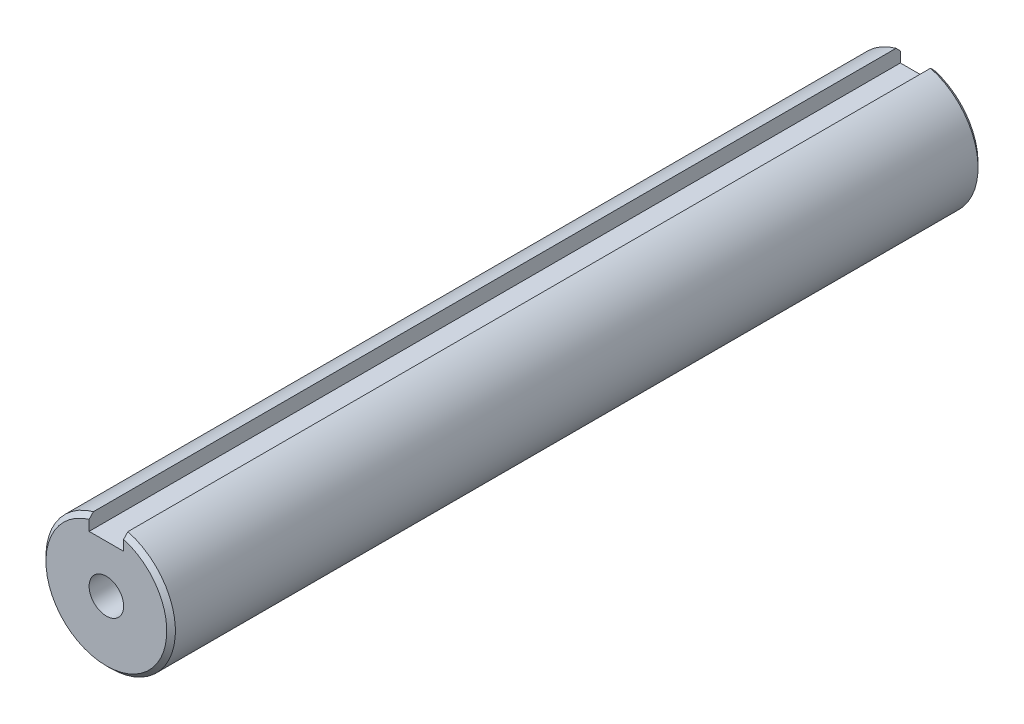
ISO-10303-21;
HEADER;
FILE_DESCRIPTION(('STEP AP214'),'2;1');
FILE_NAME('part.step','',(''),(''),'','','');
FILE_SCHEMA(('AUTOMOTIVE_DESIGN { 1 0 10303 214 1 1 1 1 }'));
ENDSEC;
DATA;
#1=APPLICATION_CONTEXT('core data for automotive mechanical design processes');
#2=APPLICATION_PROTOCOL_DEFINITION('international standard','automotive_design',2000,#1);
#3=PRODUCT_CONTEXT('',#1,'mechanical');
#4=PRODUCT('Part','Part','',(#3));
#5=PRODUCT_RELATED_PRODUCT_CATEGORY('part','',(#4));
#6=PRODUCT_DEFINITION_FORMATION('','',#4);
#7=PRODUCT_DEFINITION_CONTEXT('part definition',#1,'design');
#8=PRODUCT_DEFINITION('design','',#6,#7);
#9=PRODUCT_DEFINITION_SHAPE('','',#8);
#10=(LENGTH_UNIT() NAMED_UNIT(*) SI_UNIT(.MILLI.,.METRE.));
#11=(NAMED_UNIT(*) PLANE_ANGLE_UNIT() SI_UNIT($,.RADIAN.));
#12=(NAMED_UNIT(*) SI_UNIT($,.STERADIAN.) SOLID_ANGLE_UNIT());
#13=UNCERTAINTY_MEASURE_WITH_UNIT(LENGTH_MEASURE(1.E-05),#10,'distance_accuracy_value','');
#14=(GEOMETRIC_REPRESENTATION_CONTEXT(3) GLOBAL_UNCERTAINTY_ASSIGNED_CONTEXT((#13)) GLOBAL_UNIT_ASSIGNED_CONTEXT((#10,
#11,#12)) REPRESENTATION_CONTEXT('',''));
#15=CARTESIAN_POINT('',(0.,0.,0.));
#16=DIRECTION('',(0.,0.,1.));
#17=DIRECTION('',(1.,0.,0.));
#18=AXIS2_PLACEMENT_3D('',#15,#16,#17);
#19=CARTESIAN_POINT('',(0.,0.,94.));
#20=DIRECTION('',(0.,0.,-1.));
#21=DIRECTION('',(-1.,0.,0.));
#22=AXIS2_PLACEMENT_3D('',#19,#20,#21);
#23=CYLINDRICAL_SURFACE('',#22,15.);
#24=DIRECTION('',(0.,0.,-1.));
#25=VECTOR('',#24,1.);
#26=CARTESIAN_POINT('',(-4.,14.456832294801,94.));
#27=LINE('',#26,#25);
#28=CARTESIAN_POINT('',(-4.,14.456832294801,93.));
#29=VERTEX_POINT('',#28);
#30=CARTESIAN_POINT('',(-4.,14.456832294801,-93.));
#31=VERTEX_POINT('',#30);
#32=EDGE_CURVE('E135',#29,#31,#27,.T.);
#33=ORIENTED_EDGE('',*,*,#32,.T.);
#34=CARTESIAN_POINT('',(0.,0.,-93.));
#35=DIRECTION('',(0.,0.,1.));
#36=DIRECTION('',(1.,0.,0.));
#37=AXIS2_PLACEMENT_3D('',#34,#35,#36);
#38=CIRCLE('',#37,15.);
#39=CARTESIAN_POINT('',(4.,14.456832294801,-93.));
#40=VERTEX_POINT('',#39);
#41=EDGE_CURVE('E149',#31,#40,#38,.T.);
#42=ORIENTED_EDGE('',*,*,#41,.T.);
#43=DIRECTION('',(0.,0.,-1.));
#44=VECTOR('',#43,1.);
#45=CARTESIAN_POINT('',(4.,14.456832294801,94.));
#46=LINE('',#45,#44);
#47=CARTESIAN_POINT('',(4.,14.456832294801,93.));
#48=VERTEX_POINT('',#47);
#49=EDGE_CURVE('E144',#48,#40,#46,.T.);
#50=ORIENTED_EDGE('',*,*,#49,.F.);
#51=CARTESIAN_POINT('',(0.,0.,93.));
#52=DIRECTION('',(0.,0.,1.));
#53=DIRECTION('',(1.,0.,0.));
#54=AXIS2_PLACEMENT_3D('',#51,#52,#53);
#55=CIRCLE('',#54,15.);
#56=EDGE_CURVE('E147',#48,#29,#55,.F.);
#57=ORIENTED_EDGE('',*,*,#56,.T.);
#58=EDGE_LOOP('',(#33,#42,#50,#57));
#59=FACE_BOUND('',#58,.T.);
#60=ADVANCED_FACE('F31',(#59),#23,.T.);
#61=CARTESIAN_POINT('',(4.,14.456832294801,94.));
#62=DIRECTION('',(1.,0.,0.));
#63=DIRECTION('',(0.,0.,-1.));
#64=AXIS2_PLACEMENT_3D('',#61,#62,#63);
#65=PLANE('',#64);
#66=ORIENTED_EDGE('',*,*,#49,.T.);
#67=CARTESIAN_POINT('',(4.,14.456832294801,-93.));
#68=CARTESIAN_POINT('',(4.,14.2836650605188,-93.166913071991));
#69=CARTESIAN_POINT('',(4.,14.1103794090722,-93.3337029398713));
#70=CARTESIAN_POINT('',(4.,13.7635712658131,-93.6670362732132));
#71=CARTESIAN_POINT('',(4.,13.5900487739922,-93.8335797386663));
#72=CARTESIAN_POINT('',(4.,13.4164078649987,-94.));
#73=B_SPLINE_CURVE_WITH_KNOTS('',3,(#67,#68,#69,#70,#71,#72),.UNSPECIFIED.,.F.,.F.,(4,2,4),(0.,
0.721540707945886,1.44308144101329),.UNSPECIFIED.);
#74=CARTESIAN_POINT('',(4.,13.4164078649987,-94.));
#75=VERTEX_POINT('',#74);
#76=EDGE_CURVE('E158',#40,#75,#73,.T.);
#77=ORIENTED_EDGE('',*,*,#76,.T.);
#78=DIRECTION('',(0.,-1.,0.));
#79=VECTOR('',#78,1.);
#80=CARTESIAN_POINT('',(4.,14.456832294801,-94.));
#81=LINE('',#80,#79);
#82=CARTESIAN_POINT('',(4.,11.,-94.));
#83=VERTEX_POINT('',#82);
#84=EDGE_CURVE('E123',#75,#83,#81,.T.);
#85=ORIENTED_EDGE('',*,*,#84,.T.);
#86=DIRECTION('',(0.,0.,-1.));
#87=VECTOR('',#86,1.);
#88=CARTESIAN_POINT('',(4.,11.,94.));
#89=LINE('',#88,#87);
#90=CARTESIAN_POINT('',(4.,11.,94.));
#91=VERTEX_POINT('',#90);
#92=EDGE_CURVE('E141',#91,#83,#89,.T.);
#93=ORIENTED_EDGE('',*,*,#92,.F.);
#94=DIRECTION('',(0.,-1.,0.));
#95=VECTOR('',#94,1.);
#96=CARTESIAN_POINT('',(4.,14.456832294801,94.));
#97=LINE('',#96,#95);
#98=CARTESIAN_POINT('',(4.,13.4164078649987,94.));
#99=VERTEX_POINT('',#98);
#100=EDGE_CURVE('E129',#99,#91,#97,.T.);
#101=ORIENTED_EDGE('',*,*,#100,.F.);
#102=CARTESIAN_POINT('',(4.,13.4164078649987,94.));
#103=CARTESIAN_POINT('',(4.,13.5900487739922,93.8335797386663));
#104=CARTESIAN_POINT('',(4.,13.7635712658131,93.6670362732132));
#105=CARTESIAN_POINT('',(4.,14.1103794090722,93.3337029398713));
#106=CARTESIAN_POINT('',(4.,14.2836650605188,93.166913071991));
#107=CARTESIAN_POINT('',(4.,14.456832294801,93.));
#108=B_SPLINE_CURVE_WITH_KNOTS('',3,(#102,#103,#104,#105,#106,#107),.UNSPECIFIED.,.F.,.F.,(4,2,
4),(0.,0.7215407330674,1.4430814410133),.UNSPECIFIED.);
#109=EDGE_CURVE('E152',#99,#48,#108,.T.);
#110=ORIENTED_EDGE('',*,*,#109,.T.);
#111=EDGE_LOOP('',(#66,#77,#85,#93,#101,#110));
#112=FACE_BOUND('',#111,.T.);
#113=ADVANCED_FACE('F167',(#112),#65,.F.);
#114=CARTESIAN_POINT('',(-4.,11.,94.));
#115=DIRECTION('',(0.,-1.,0.));
#116=DIRECTION('',(0.,0.,-1.));
#117=AXIS2_PLACEMENT_3D('',#114,#115,#116);
#118=PLANE('',#117);
#119=DIRECTION('',(-1.,0.,0.));
#120=VECTOR('',#119,1.);
#121=CARTESIAN_POINT('',(-4.,11.,-94.));
#122=LINE('',#121,#120);
#123=CARTESIAN_POINT('',(-4.,11.,-94.));
#124=VERTEX_POINT('',#123);
#125=EDGE_CURVE('E125',#83,#124,#122,.T.);
#126=ORIENTED_EDGE('',*,*,#125,.T.);
#127=DIRECTION('',(0.,0.,-1.));
#128=VECTOR('',#127,1.);
#129=CARTESIAN_POINT('',(-4.,11.,94.));
#130=LINE('',#129,#128);
#131=CARTESIAN_POINT('',(-4.,11.,94.));
#132=VERTEX_POINT('',#131);
#133=EDGE_CURVE('E138',#132,#124,#130,.T.);
#134=ORIENTED_EDGE('',*,*,#133,.F.);
#135=DIRECTION('',(-1.,0.,0.));
#136=VECTOR('',#135,1.);
#137=CARTESIAN_POINT('',(-4.,11.,94.));
#138=LINE('',#137,#136);
#139=EDGE_CURVE('E131',#91,#132,#138,.T.);
#140=ORIENTED_EDGE('',*,*,#139,.F.);
#141=ORIENTED_EDGE('',*,*,#92,.T.);
#142=EDGE_LOOP('',(#126,#134,#140,#141));
#143=FACE_BOUND('',#142,.T.);
#144=ADVANCED_FACE('F171',(#143),#118,.F.);
#145=CARTESIAN_POINT('',(-4.,14.456832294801,94.));
#146=DIRECTION('',(-1.,0.,0.));
#147=DIRECTION('',(0.,0.,1.));
#148=AXIS2_PLACEMENT_3D('',#145,#146,#147);
#149=PLANE('',#148);
#150=DIRECTION('',(0.,1.,0.));
#151=VECTOR('',#150,1.);
#152=CARTESIAN_POINT('',(-4.,14.456832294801,-94.));
#153=LINE('',#152,#151);
#154=CARTESIAN_POINT('',(-4.,13.4164078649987,-94.));
#155=VERTEX_POINT('',#154);
#156=EDGE_CURVE('E127',#124,#155,#153,.T.);
#157=ORIENTED_EDGE('',*,*,#156,.T.);
#158=CARTESIAN_POINT('',(-4.,13.4164078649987,-94.));
#159=CARTESIAN_POINT('',(-4.,13.5900487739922,-93.8335797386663));
#160=CARTESIAN_POINT('',(-4.,13.7635712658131,-93.6670362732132));
#161=CARTESIAN_POINT('',(-4.,14.1103794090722,-93.3337029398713));
#162=CARTESIAN_POINT('',(-4.,14.2836650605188,-93.166913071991));
#163=CARTESIAN_POINT('',(-4.,14.456832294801,-93.));
#164=B_SPLINE_CURVE_WITH_KNOTS('',3,(#158,#159,#160,#161,#162,#163),.UNSPECIFIED.,.F.,.F.,(4,2,
4),(0.,0.721540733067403,1.44308144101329),.UNSPECIFIED.);
#165=EDGE_CURVE('E38',#155,#31,#164,.T.);
#166=ORIENTED_EDGE('',*,*,#165,.T.);
#167=ORIENTED_EDGE('',*,*,#32,.F.);
#168=CARTESIAN_POINT('',(-4.,14.456832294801,93.));
#169=CARTESIAN_POINT('',(-4.,14.2836650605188,93.166913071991));
#170=CARTESIAN_POINT('',(-4.,14.1103794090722,93.3337029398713));
#171=CARTESIAN_POINT('',(-4.,13.763571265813,93.6670362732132));
#172=CARTESIAN_POINT('',(-4.,13.5900487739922,93.8335797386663));
#173=CARTESIAN_POINT('',(-4.,13.4164078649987,94.));
#174=B_SPLINE_CURVE_WITH_KNOTS('',3,(#168,#169,#170,#171,#172,#173),.UNSPECIFIED.,.F.,.F.,(4,2,
4),(0.,0.721540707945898,1.4430814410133),.UNSPECIFIED.);
#175=CARTESIAN_POINT('',(-4.,13.4164078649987,94.));
#176=VERTEX_POINT('',#175);
#177=EDGE_CURVE('E45',#29,#176,#174,.T.);
#178=ORIENTED_EDGE('',*,*,#177,.T.);
#179=DIRECTION('',(0.,1.,0.));
#180=VECTOR('',#179,1.);
#181=CARTESIAN_POINT('',(-4.,14.456832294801,94.));
#182=LINE('',#181,#180);
#183=EDGE_CURVE('E133',#132,#176,#182,.T.);
#184=ORIENTED_EDGE('',*,*,#183,.F.);
#185=ORIENTED_EDGE('',*,*,#133,.T.);
#186=EDGE_LOOP('',(#157,#166,#167,#178,#184,#185));
#187=FACE_BOUND('',#186,.T.);
#188=ADVANCED_FACE('F176',(#187),#149,.F.);
#189=CARTESIAN_POINT('',(0.,0.,94.));
#190=DIRECTION('',(0.,0.,1.));
#191=DIRECTION('',(1.,0.,0.));
#192=AXIS2_PLACEMENT_3D('',#189,#190,#191);
#193=PLANE('',#192);
#194=CARTESIAN_POINT('',(0.,0.,94.));
#195=DIRECTION('',(0.,0.,1.));
#196=DIRECTION('',(1.,0.,0.));
#197=AXIS2_PLACEMENT_3D('',#194,#195,#196);
#198=CIRCLE('',#197,4.);
#199=CARTESIAN_POINT('',(4.,0.,94.));
#200=VERTEX_POINT('',#199);
#201=EDGE_CURVE('E120',#200,#200,#198,.T.);
#202=ORIENTED_EDGE('',*,*,#201,.F.);
#203=EDGE_LOOP('',(#202));
#204=FACE_BOUND('',#203,.T.);
#205=ORIENTED_EDGE('',*,*,#183,.T.);
#206=CARTESIAN_POINT('',(0.,0.,94.));
#207=DIRECTION('',(0.,0.,1.));
#208=DIRECTION('',(1.,0.,0.));
#209=AXIS2_PLACEMENT_3D('',#206,#207,#208);
#210=CIRCLE('',#209,14.);
#211=EDGE_CURVE('E11',#176,#99,#210,.T.);
#212=ORIENTED_EDGE('',*,*,#211,.T.);
#213=ORIENTED_EDGE('',*,*,#100,.T.);
#214=ORIENTED_EDGE('',*,*,#139,.T.);
#215=EDGE_LOOP('',(#205,#212,#213,#214));
#216=FACE_BOUND('',#215,.T.);
#217=ADVANCED_FACE('F181',(#204,#216),#193,.T.);
#218=CARTESIAN_POINT('',(0.,0.,-94.));
#219=DIRECTION('',(0.,0.,1.));
#220=DIRECTION('',(1.,0.,0.));
#221=AXIS2_PLACEMENT_3D('',#218,#219,#220);
#222=PLANE('',#221);
#223=CARTESIAN_POINT('',(0.,0.,-94.));
#224=DIRECTION('',(0.,0.,-1.));
#225=DIRECTION('',(-1.,0.,0.));
#226=AXIS2_PLACEMENT_3D('',#223,#224,#225);
#227=CIRCLE('',#226,3.99999999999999);
#228=CARTESIAN_POINT('',(-3.99999999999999,0.,-94.));
#229=VERTEX_POINT('',#228);
#230=EDGE_CURVE('E108',#229,#229,#227,.T.);
#231=ORIENTED_EDGE('',*,*,#230,.F.);
#232=EDGE_LOOP('',(#231));
#233=FACE_BOUND('',#232,.T.);
#234=ORIENTED_EDGE('',*,*,#84,.F.);
#235=CARTESIAN_POINT('',(0.,0.,-94.));
#236=DIRECTION('',(0.,0.,1.));
#237=DIRECTION('',(1.,0.,0.));
#238=AXIS2_PLACEMENT_3D('',#235,#236,#237);
#239=CIRCLE('',#238,14.);
#240=EDGE_CURVE('E53',#75,#155,#239,.F.);
#241=ORIENTED_EDGE('',*,*,#240,.T.);
#242=ORIENTED_EDGE('',*,*,#156,.F.);
#243=ORIENTED_EDGE('',*,*,#125,.F.);
#244=EDGE_LOOP('',(#234,#241,#242,#243));
#245=FACE_BOUND('',#244,.T.);
#246=ADVANCED_FACE('F194',(#233,#245),#222,.F.);
#247=CARTESIAN_POINT('',(0.,0.,-93.));
#248=DIRECTION('',(0.,0.,1.));
#249=DIRECTION('',(1.,0.,0.));
#250=AXIS2_PLACEMENT_3D('',#247,#248,#249);
#251=CONICAL_SURFACE('',#250,15.,0.785398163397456);
#252=ORIENTED_EDGE('',*,*,#165,.F.);
#253=ORIENTED_EDGE('',*,*,#240,.F.);
#254=ORIENTED_EDGE('',*,*,#76,.F.);
#255=ORIENTED_EDGE('',*,*,#41,.F.);
#256=EDGE_LOOP('',(#252,#253,#254,#255));
#257=FACE_BOUND('',#256,.T.);
#258=ADVANCED_FACE('F191',(#257),#251,.T.);
#259=CARTESIAN_POINT('',(0.,0.,94.));
#260=DIRECTION('',(0.,0.,-1.));
#261=DIRECTION('',(-1.,0.,0.));
#262=AXIS2_PLACEMENT_3D('',#259,#260,#261);
#263=CONICAL_SURFACE('',#262,14.,0.785398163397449);
#264=ORIENTED_EDGE('',*,*,#177,.F.);
#265=ORIENTED_EDGE('',*,*,#56,.F.);
#266=ORIENTED_EDGE('',*,*,#109,.F.);
#267=ORIENTED_EDGE('',*,*,#211,.F.);
#268=EDGE_LOOP('',(#264,#265,#266,#267));
#269=FACE_BOUND('',#268,.T.);
#270=ADVANCED_FACE('F164',(#269),#263,.T.);
#271=CARTESIAN_POINT('',(0.,0.,94.));
#272=DIRECTION('',(0.,0.,1.));
#273=DIRECTION('',(1.,0.,0.));
#274=AXIS2_PLACEMENT_3D('',#271,#272,#273);
#275=CYLINDRICAL_SURFACE('',#274,4.);
#276=CARTESIAN_POINT('',(0.,0.,74.));
#277=DIRECTION('',(0.,0.,1.));
#278=DIRECTION('',(1.,0.,0.));
#279=AXIS2_PLACEMENT_3D('',#276,#277,#278);
#280=CIRCLE('',#279,4.);
#281=CARTESIAN_POINT('',(4.,0.,74.));
#282=VERTEX_POINT('',#281);
#283=EDGE_CURVE('E117',#282,#282,#280,.T.);
#284=ORIENTED_EDGE('',*,*,#283,.F.);
#285=EDGE_LOOP('',(#284));
#286=FACE_BOUND('',#285,.T.);
#287=ORIENTED_EDGE('',*,*,#201,.T.);
#288=EDGE_LOOP('',(#287));
#289=FACE_BOUND('',#288,.T.);
#290=ADVANCED_FACE('F221',(#286,#289),#275,.F.);
#291=CARTESIAN_POINT('',(3.39999999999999,0.,74.));
#292=DIRECTION('',(0.,0.,-1.));
#293=DIRECTION('',(-1.,0.,0.));
#294=AXIS2_PLACEMENT_3D('',#291,#292,#293);
#295=PLANE('',#294);
#296=CARTESIAN_POINT('',(0.,0.,74.));
#297=DIRECTION('',(0.,0.,1.));
#298=DIRECTION('',(1.,0.,0.));
#299=AXIS2_PLACEMENT_3D('',#296,#297,#298);
#300=CIRCLE('',#299,3.39999999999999);
#301=CARTESIAN_POINT('',(3.39999999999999,0.,74.));
#302=VERTEX_POINT('',#301);
#303=EDGE_CURVE('E114',#302,#302,#300,.T.);
#304=ORIENTED_EDGE('',*,*,#303,.F.);
#305=EDGE_LOOP('',(#304));
#306=FACE_BOUND('',#305,.T.);
#307=ORIENTED_EDGE('',*,*,#283,.T.);
#308=EDGE_LOOP('',(#307));
#309=FACE_BOUND('',#308,.T.);
#310=ADVANCED_FACE('F225',(#306,#309),#295,.F.);
#311=CARTESIAN_POINT('',(0.,0.,94.));
#312=DIRECTION('',(0.,0.,1.));
#313=DIRECTION('',(1.,0.,0.));
#314=AXIS2_PLACEMENT_3D('',#311,#312,#313);
#315=CYLINDRICAL_SURFACE('',#314,3.39999999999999);
#316=CARTESIAN_POINT('',(0.,0.,69.));
#317=DIRECTION('',(0.,0.,1.));
#318=DIRECTION('',(1.,0.,0.));
#319=AXIS2_PLACEMENT_3D('',#316,#317,#318);
#320=CIRCLE('',#319,3.39999999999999);
#321=CARTESIAN_POINT('',(3.39999999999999,0.,69.));
#322=VERTEX_POINT('',#321);
#323=EDGE_CURVE('E111',#322,#322,#320,.T.);
#324=ORIENTED_EDGE('',*,*,#323,.F.);
#325=EDGE_LOOP('',(#324));
#326=FACE_BOUND('',#325,.T.);
#327=ORIENTED_EDGE('',*,*,#303,.T.);
#328=EDGE_LOOP('',(#327));
#329=FACE_BOUND('',#328,.T.);
#330=ADVANCED_FACE('F230',(#326,#329),#315,.F.);
#331=CARTESIAN_POINT('',(0.,0.,69.));
#332=DIRECTION('',(0.,0.,1.));
#333=DIRECTION('',(1.,0.,0.));
#334=AXIS2_PLACEMENT_3D('',#331,#332,#333);
#335=CONICAL_SURFACE('',#334,3.39999999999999,1.02974425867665);
#336=CARTESIAN_POINT('',(0.,0.,66.9570738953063));
#337=VERTEX_POINT('',#336);
#338=VERTEX_LOOP('',#337);
#339=FACE_BOUND('',#338,.T.);
#340=ORIENTED_EDGE('',*,*,#323,.T.);
#341=EDGE_LOOP('',(#340));
#342=FACE_BOUND('',#341,.T.);
#343=ADVANCED_FACE('F238',(#339,#342),#335,.F.);
#344=CARTESIAN_POINT('',(0.,0.,-94.));
#345=DIRECTION('',(0.,0.,-1.));
#346=DIRECTION('',(-1.,0.,0.));
#347=AXIS2_PLACEMENT_3D('',#344,#345,#346);
#348=CYLINDRICAL_SURFACE('',#347,3.99999999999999);
#349=CARTESIAN_POINT('',(0.,0.,-74.));
#350=DIRECTION('',(0.,0.,-1.));
#351=DIRECTION('',(-1.,0.,0.));
#352=AXIS2_PLACEMENT_3D('',#349,#350,#351);
#353=CIRCLE('',#352,3.99999999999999);
#354=CARTESIAN_POINT('',(-3.99999999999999,0.,-74.));
#355=VERTEX_POINT('',#354);
#356=EDGE_CURVE('E103',#355,#355,#353,.T.);
#357=ORIENTED_EDGE('',*,*,#356,.F.);
#358=EDGE_LOOP('',(#357));
#359=FACE_BOUND('',#358,.T.);
#360=ORIENTED_EDGE('',*,*,#230,.T.);
#361=EDGE_LOOP('',(#360));
#362=FACE_BOUND('',#361,.T.);
#363=ADVANCED_FACE('F242',(#359,#362),#348,.F.);
#364=CARTESIAN_POINT('',(3.39999999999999,0.,-74.));
#365=DIRECTION('',(0.,0.,1.));
#366=DIRECTION('',(1.,0.,0.));
#367=AXIS2_PLACEMENT_3D('',#364,#365,#366);
#368=PLANE('',#367);
#369=CARTESIAN_POINT('',(0.,0.,-74.));
#370=DIRECTION('',(0.,0.,-1.));
#371=DIRECTION('',(-1.,0.,0.));
#372=AXIS2_PLACEMENT_3D('',#369,#370,#371);
#373=CIRCLE('',#372,3.39999999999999);
#374=CARTESIAN_POINT('',(-3.39999999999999,0.,-74.));
#375=VERTEX_POINT('',#374);
#376=EDGE_CURVE('E100',#375,#375,#373,.T.);
#377=ORIENTED_EDGE('',*,*,#376,.F.);
#378=EDGE_LOOP('',(#377));
#379=FACE_BOUND('',#378,.T.);
#380=ORIENTED_EDGE('',*,*,#356,.T.);
#381=EDGE_LOOP('',(#380));
#382=FACE_BOUND('',#381,.T.);
#383=ADVANCED_FACE('F246',(#379,#382),#368,.F.);
#384=CARTESIAN_POINT('',(0.,0.,-94.));
#385=DIRECTION('',(0.,0.,-1.));
#386=DIRECTION('',(-1.,0.,0.));
#387=AXIS2_PLACEMENT_3D('',#384,#385,#386);
#388=CYLINDRICAL_SURFACE('',#387,3.39999999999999);
#389=CARTESIAN_POINT('',(0.,0.,-69.));
#390=DIRECTION('',(0.,0.,-1.));
#391=DIRECTION('',(-1.,0.,0.));
#392=AXIS2_PLACEMENT_3D('',#389,#390,#391);
#393=CIRCLE('',#392,3.39999999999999);
#394=CARTESIAN_POINT('',(-3.39999999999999,0.,-69.));
#395=VERTEX_POINT('',#394);
#396=EDGE_CURVE('E98',#395,#395,#393,.T.);
#397=ORIENTED_EDGE('',*,*,#396,.F.);
#398=EDGE_LOOP('',(#397));
#399=FACE_BOUND('',#398,.T.);
#400=ORIENTED_EDGE('',*,*,#376,.T.);
#401=EDGE_LOOP('',(#400));
#402=FACE_BOUND('',#401,.T.);
#403=ADVANCED_FACE('F94',(#399,#402),#388,.F.);
#404=CARTESIAN_POINT('',(0.,0.,-69.));
#405=DIRECTION('',(0.,0.,-1.));
#406=DIRECTION('',(-1.,0.,0.));
#407=AXIS2_PLACEMENT_3D('',#404,#405,#406);
#408=CONICAL_SURFACE('',#407,3.39999999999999,1.02974425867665);
#409=CARTESIAN_POINT('',(0.,0.,-66.9570738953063));
#410=VERTEX_POINT('',#409);
#411=VERTEX_LOOP('',#410);
#412=FACE_BOUND('',#411,.T.);
#413=ORIENTED_EDGE('',*,*,#396,.T.);
#414=EDGE_LOOP('',(#413));
#415=FACE_BOUND('',#414,.T.);
#416=ADVANCED_FACE('F91',(#412,#415),#408,.F.);
#417=CLOSED_SHELL('',(#60,#113,#144,#188,#217,#246,#258,#270,#290,#310,#330,#343,#363,#383,#403,#416));
#418=MANIFOLD_SOLID_BREP('B2',#417);
#419=ADVANCED_BREP_SHAPE_REPRESENTATION('',(#18,#418),#14);
#420=SHAPE_DEFINITION_REPRESENTATION(#9,#419);
ENDSEC;
END-ISO-10303-21;
